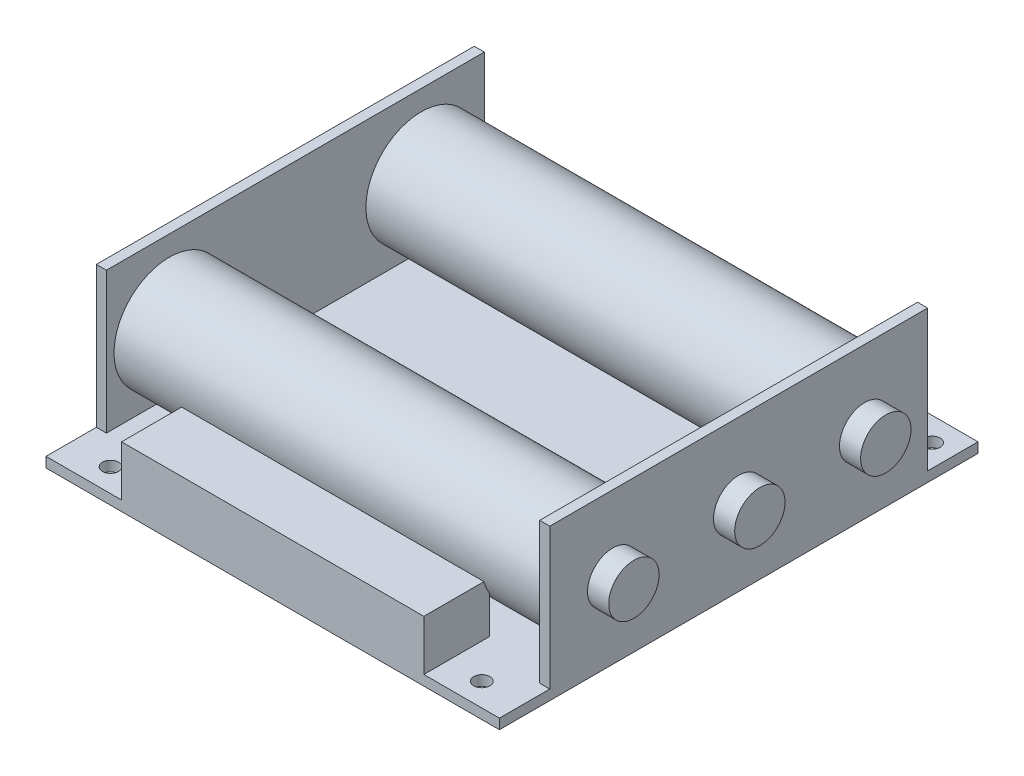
ISO-10303-21;
HEADER;
FILE_DESCRIPTION(('STEP AP214'),'2;1');
FILE_NAME('part.step','',(''),(''),'','','');
FILE_SCHEMA(('AUTOMOTIVE_DESIGN { 1 0 10303 214 1 1 1 1 }'));
ENDSEC;
DATA;
#1=APPLICATION_CONTEXT('core data for automotive mechanical design processes');
#2=APPLICATION_PROTOCOL_DEFINITION('international standard','automotive_design',2000,#1);
#3=PRODUCT_CONTEXT('',#1,'mechanical');
#4=PRODUCT('Part','Part','',(#3));
#5=PRODUCT_RELATED_PRODUCT_CATEGORY('part','',(#4));
#6=PRODUCT_DEFINITION_FORMATION('','',#4);
#7=PRODUCT_DEFINITION_CONTEXT('part definition',#1,'design');
#8=PRODUCT_DEFINITION('design','',#6,#7);
#9=PRODUCT_DEFINITION_SHAPE('','',#8);
#10=(LENGTH_UNIT() NAMED_UNIT(*) SI_UNIT(.MILLI.,.METRE.));
#11=(NAMED_UNIT(*) PLANE_ANGLE_UNIT() SI_UNIT($,.RADIAN.));
#12=(NAMED_UNIT(*) SI_UNIT($,.STERADIAN.) SOLID_ANGLE_UNIT());
#13=UNCERTAINTY_MEASURE_WITH_UNIT(LENGTH_MEASURE(1.E-05),#10,'distance_accuracy_value','');
#14=(GEOMETRIC_REPRESENTATION_CONTEXT(3) GLOBAL_UNCERTAINTY_ASSIGNED_CONTEXT((#13)) GLOBAL_UNIT_ASSIGNED_CONTEXT((#10,
#11,#12)) REPRESENTATION_CONTEXT('',''));
#15=CARTESIAN_POINT('',(0.,0.,0.));
#16=DIRECTION('',(0.,0.,1.));
#17=DIRECTION('',(1.,0.,0.));
#18=AXIS2_PLACEMENT_3D('',#15,#16,#17);
#19=CARTESIAN_POINT('',(-49.2,15.,25.));
#20=DIRECTION('',(1.,0.,0.));
#21=DIRECTION('',(0.,0.,-1.));
#22=AXIS2_PLACEMENT_3D('',#19,#20,#21);
#23=CYLINDRICAL_SURFACE('',#22,11.);
#24=CARTESIAN_POINT('',(43.,15.,25.));
#25=DIRECTION('',(1.,0.,0.));
#26=DIRECTION('',(0.,0.,-1.));
#27=AXIS2_PLACEMENT_3D('',#24,#25,#26);
#28=CIRCLE('',#27,11.);
#29=CARTESIAN_POINT('',(43.,15.,14.));
#30=VERTEX_POINT('',#29);
#31=EDGE_CURVE('E11',#30,#30,#28,.F.);
#32=ORIENTED_EDGE('',*,*,#31,.T.);
#33=EDGE_LOOP('',(#32));
#34=FACE_BOUND('',#33,.T.);
#35=CARTESIAN_POINT('',(-43.,15.,25.));
#36=DIRECTION('',(1.,0.,0.));
#37=DIRECTION('',(0.,0.,-1.));
#38=AXIS2_PLACEMENT_3D('',#35,#36,#37);
#39=CIRCLE('',#38,11.);
#40=CARTESIAN_POINT('',(-43.,15.,14.));
#41=VERTEX_POINT('',#40);
#42=EDGE_CURVE('E47',#41,#41,#39,.T.);
#43=ORIENTED_EDGE('',*,*,#42,.T.);
#44=EDGE_LOOP('',(#43));
#45=FACE_BOUND('',#44,.T.);
#46=ADVANCED_FACE('F46',(#34,#45),#23,.T.);
#47=OPEN_SHELL('',(#46));
#48=SHELL_BASED_SURFACE_MODEL('B2',(#47));
#49=CARTESIAN_POINT('',(-49.2,15.,-25.));
#50=DIRECTION('',(1.,0.,0.));
#51=DIRECTION('',(0.,0.,-1.));
#52=AXIS2_PLACEMENT_3D('',#49,#50,#51);
#53=CYLINDRICAL_SURFACE('',#52,11.);
#54=CARTESIAN_POINT('',(43.,15.,-25.));
#55=DIRECTION('',(1.,0.,0.));
#56=DIRECTION('',(0.,0.,-1.));
#57=AXIS2_PLACEMENT_3D('',#54,#55,#56);
#58=CIRCLE('',#57,11.);
#59=CARTESIAN_POINT('',(43.,15.,-36.));
#60=VERTEX_POINT('',#59);
#61=EDGE_CURVE('E86',#60,#60,#58,.F.);
#62=ORIENTED_EDGE('',*,*,#61,.T.);
#63=EDGE_LOOP('',(#62));
#64=FACE_BOUND('',#63,.T.);
#65=CARTESIAN_POINT('',(-43.,15.,-25.));
#66=DIRECTION('',(1.,0.,0.));
#67=DIRECTION('',(0.,0.,-1.));
#68=AXIS2_PLACEMENT_3D('',#65,#66,#67);
#69=CIRCLE('',#68,11.);
#70=CARTESIAN_POINT('',(-43.,15.,-36.));
#71=VERTEX_POINT('',#70);
#72=EDGE_CURVE('E45',#71,#71,#69,.T.);
#73=ORIENTED_EDGE('',*,*,#72,.T.);
#74=EDGE_LOOP('',(#73));
#75=FACE_BOUND('',#74,.T.);
#76=ADVANCED_FACE('F82',(#64,#75),#53,.T.);
#77=OPEN_SHELL('',(#76));
#78=SHELL_BASED_SURFACE_MODEL('B6',(#77));
#79=CARTESIAN_POINT('',(-45.,2.,-47.5));
#80=DIRECTION('',(1.,0.,0.));
#81=DIRECTION('',(0.,0.,-1.));
#82=AXIS2_PLACEMENT_3D('',#79,#80,#81);
#83=PLANE('',#82);
#84=DIRECTION('',(0.,0.,1.));
#85=VECTOR('',#84,1.);
#86=CARTESIAN_POINT('',(-45.,0.,-47.5));
#87=LINE('',#86,#85);
#88=CARTESIAN_POINT('',(-45.,0.,-47.5));
#89=VERTEX_POINT('',#88);
#90=CARTESIAN_POINT('',(-45.,0.,47.5));
#91=VERTEX_POINT('',#90);
#92=EDGE_CURVE('E358',#89,#91,#87,.T.);
#93=ORIENTED_EDGE('',*,*,#92,.T.);
#94=DIRECTION('',(0.,-1.,0.));
#95=VECTOR('',#94,1.);
#96=CARTESIAN_POINT('',(-45.,2.,47.5));
#97=LINE('',#96,#95);
#98=CARTESIAN_POINT('',(-45.,2.,47.5));
#99=VERTEX_POINT('',#98);
#100=EDGE_CURVE('E386',#99,#91,#97,.T.);
#101=ORIENTED_EDGE('',*,*,#100,.F.);
#102=DIRECTION('',(0.,0.,1.));
#103=VECTOR('',#102,1.);
#104=CARTESIAN_POINT('',(-45.,2.,-47.5));
#105=LINE('',#104,#103);
#106=CARTESIAN_POINT('',(-45.,2.,37.5));
#107=VERTEX_POINT('',#106);
#108=EDGE_CURVE('E362',#107,#99,#105,.T.);
#109=ORIENTED_EDGE('',*,*,#108,.F.);
#110=DIRECTION('',(0.,-1.,0.));
#111=VECTOR('',#110,1.);
#112=CARTESIAN_POINT('',(-45.,0.,37.5));
#113=LINE('',#112,#111);
#114=CARTESIAN_POINT('',(-45.,30.,37.5));
#115=VERTEX_POINT('',#114);
#116=EDGE_CURVE('E278',#115,#107,#113,.T.);
#117=ORIENTED_EDGE('',*,*,#116,.F.);
#118=DIRECTION('',(0.,0.,1.));
#119=VECTOR('',#118,1.);
#120=CARTESIAN_POINT('',(-45.,30.,37.5));
#121=LINE('',#120,#119);
#122=CARTESIAN_POINT('',(-45.,30.,-37.5));
#123=VERTEX_POINT('',#122);
#124=EDGE_CURVE('E290',#123,#115,#121,.T.);
#125=ORIENTED_EDGE('',*,*,#124,.F.);
#126=DIRECTION('',(0.,1.,0.));
#127=VECTOR('',#126,1.);
#128=CARTESIAN_POINT('',(-45.,0.,-37.5));
#129=LINE('',#128,#127);
#130=CARTESIAN_POINT('',(-45.,2.,-37.5));
#131=VERTEX_POINT('',#130);
#132=EDGE_CURVE('E283',#131,#123,#129,.T.);
#133=ORIENTED_EDGE('',*,*,#132,.F.);
#134=CARTESIAN_POINT('',(-45.,2.,-47.5));
#135=VERTEX_POINT('',#134);
#136=EDGE_CURVE('E359',#135,#131,#105,.T.);
#137=ORIENTED_EDGE('',*,*,#136,.F.);
#138=DIRECTION('',(0.,-1.,0.));
#139=VECTOR('',#138,1.);
#140=CARTESIAN_POINT('',(-45.,2.,-47.5));
#141=LINE('',#140,#139);
#142=EDGE_CURVE('E370',#135,#89,#141,.T.);
#143=ORIENTED_EDGE('',*,*,#142,.T.);
#144=EDGE_LOOP('',(#93,#101,#109,#117,#125,#133,#137,#143));
#145=FACE_BOUND('',#144,.T.);
#146=CARTESIAN_POINT('',(-45.,15.,25.));
#147=DIRECTION('',(1.,0.,0.));
#148=DIRECTION('',(0.,0.,-1.));
#149=AXIS2_PLACEMENT_3D('',#146,#147,#148);
#150=CIRCLE('',#149,5.);
#151=CARTESIAN_POINT('',(-45.,15.,20.));
#152=VERTEX_POINT('',#151);
#153=EDGE_CURVE('E275',#152,#152,#150,.T.);
#154=ORIENTED_EDGE('',*,*,#153,.T.);
#155=EDGE_LOOP('',(#154));
#156=FACE_BOUND('',#155,.T.);
#157=CARTESIAN_POINT('',(-45.,15.,-25.));
#158=DIRECTION('',(1.,0.,0.));
#159=DIRECTION('',(0.,0.,-1.));
#160=AXIS2_PLACEMENT_3D('',#157,#158,#159);
#161=CIRCLE('',#160,5.);
#162=CARTESIAN_POINT('',(-45.,15.,-30.));
#163=VERTEX_POINT('',#162);
#164=EDGE_CURVE('E259',#163,#163,#161,.T.);
#165=ORIENTED_EDGE('',*,*,#164,.T.);
#166=EDGE_LOOP('',(#165));
#167=FACE_BOUND('',#166,.T.);
#168=CARTESIAN_POINT('',(-45.,15.,0.));
#169=DIRECTION('',(1.,0.,0.));
#170=DIRECTION('',(0.,0.,-1.));
#171=AXIS2_PLACEMENT_3D('',#168,#169,#170);
#172=CIRCLE('',#171,5.);
#173=CARTESIAN_POINT('',(-45.,15.,-4.99999999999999));
#174=VERTEX_POINT('',#173);
#175=EDGE_CURVE('E80',#174,#174,#172,.F.);
#176=ORIENTED_EDGE('',*,*,#175,.F.);
#177=EDGE_LOOP('',(#176));
#178=FACE_BOUND('',#177,.T.);
#179=ADVANCED_FACE('F109',(#145,#156,#167,#178),#83,.F.);
#180=CARTESIAN_POINT('',(0.,2.,0.));
#181=DIRECTION('',(0.,-1.,0.));
#182=DIRECTION('',(0.,0.,-1.));
#183=AXIS2_PLACEMENT_3D('',#180,#181,#182);
#184=PLANE('',#183);
#185=CARTESIAN_POINT('',(-36.8,2.,42.9));
#186=DIRECTION('',(0.,-1.,0.));
#187=DIRECTION('',(0.,0.,-1.));
#188=AXIS2_PLACEMENT_3D('',#185,#186,#187);
#189=CIRCLE('',#188,1.6);
#190=CARTESIAN_POINT('',(-36.8,2.,41.3));
#191=VERTEX_POINT('',#190);
#192=EDGE_CURVE('E337',#191,#191,#189,.T.);
#193=ORIENTED_EDGE('',*,*,#192,.T.);
#194=EDGE_LOOP('',(#193));
#195=FACE_BOUND('',#194,.T.);
#196=CARTESIAN_POINT('',(36.9,2.,42.9));
#197=DIRECTION('',(0.,-1.,0.));
#198=DIRECTION('',(0.,0.,-1.));
#199=AXIS2_PLACEMENT_3D('',#196,#197,#198);
#200=CIRCLE('',#199,1.6);
#201=CARTESIAN_POINT('',(36.9,2.,41.3));
#202=VERTEX_POINT('',#201);
#203=EDGE_CURVE('E343',#202,#202,#200,.T.);
#204=ORIENTED_EDGE('',*,*,#203,.T.);
#205=EDGE_LOOP('',(#204));
#206=FACE_BOUND('',#205,.T.);
#207=CARTESIAN_POINT('',(40.6,2.,-42.8));
#208=DIRECTION('',(0.,-1.,0.));
#209=DIRECTION('',(0.,0.,-1.));
#210=AXIS2_PLACEMENT_3D('',#207,#208,#209);
#211=CIRCLE('',#210,1.6);
#212=CARTESIAN_POINT('',(40.6,2.,-44.4));
#213=VERTEX_POINT('',#212);
#214=EDGE_CURVE('E349',#213,#213,#211,.T.);
#215=ORIENTED_EDGE('',*,*,#214,.T.);
#216=EDGE_LOOP('',(#215));
#217=FACE_BOUND('',#216,.T.);
#218=CARTESIAN_POINT('',(-39.4,2.,-42.8));
#219=DIRECTION('',(0.,-1.,0.));
#220=DIRECTION('',(0.,0.,-1.));
#221=AXIS2_PLACEMENT_3D('',#218,#219,#220);
#222=CIRCLE('',#221,1.6);
#223=CARTESIAN_POINT('',(-39.4,2.,-44.4));
#224=VERTEX_POINT('',#223);
#225=EDGE_CURVE('E355',#224,#224,#222,.T.);
#226=ORIENTED_EDGE('',*,*,#225,.T.);
#227=EDGE_LOOP('',(#226));
#228=FACE_BOUND('',#227,.T.);
#229=DIRECTION('',(0.,0.,1.));
#230=VECTOR('',#229,1.);
#231=CARTESIAN_POINT('',(-30.,2.,34.5));
#232=LINE('',#231,#230);
#233=CARTESIAN_POINT('',(-30.,2.,34.5));
#234=VERTEX_POINT('',#233);
#235=CARTESIAN_POINT('',(-30.,2.,47.5));
#236=VERTEX_POINT('',#235);
#237=EDGE_CURVE('E123',#234,#236,#232,.T.);
#238=ORIENTED_EDGE('',*,*,#237,.F.);
#239=DIRECTION('',(-1.,0.,0.));
#240=VECTOR('',#239,1.);
#241=CARTESIAN_POINT('',(-30.,2.,34.5));
#242=LINE('',#241,#240);
#243=CARTESIAN_POINT('',(30.,2.,34.5));
#244=VERTEX_POINT('',#243);
#245=EDGE_CURVE('E127',#244,#234,#242,.T.);
#246=ORIENTED_EDGE('',*,*,#245,.F.);
#247=DIRECTION('',(0.,0.,-1.));
#248=VECTOR('',#247,1.);
#249=CARTESIAN_POINT('',(30.,2.,34.5));
#250=LINE('',#249,#248);
#251=CARTESIAN_POINT('',(30.,2.,47.5));
#252=VERTEX_POINT('',#251);
#253=EDGE_CURVE('E578',#252,#244,#250,.T.);
#254=ORIENTED_EDGE('',*,*,#253,.F.);
#255=DIRECTION('',(1.,0.,0.));
#256=VECTOR('',#255,1.);
#257=CARTESIAN_POINT('',(45.,2.,47.5));
#258=LINE('',#257,#256);
#259=CARTESIAN_POINT('',(45.,2.,47.5));
#260=VERTEX_POINT('',#259);
#261=EDGE_CURVE('E361',#252,#260,#258,.T.);
#262=ORIENTED_EDGE('',*,*,#261,.T.);
#263=DIRECTION('',(0.,0.,-1.));
#264=VECTOR('',#263,1.);
#265=CARTESIAN_POINT('',(45.,2.,-47.5));
#266=LINE('',#265,#264);
#267=CARTESIAN_POINT('',(45.,2.,37.5));
#268=VERTEX_POINT('',#267);
#269=EDGE_CURVE('E366',#260,#268,#266,.T.);
#270=ORIENTED_EDGE('',*,*,#269,.T.);
#271=DIRECTION('',(-1.,0.,0.));
#272=VECTOR('',#271,1.);
#273=CARTESIAN_POINT('',(0.,2.,37.5));
#274=LINE('',#273,#272);
#275=CARTESIAN_POINT('',(43.,2.,37.5));
#276=VERTEX_POINT('',#275);
#277=EDGE_CURVE('E332',#268,#276,#274,.T.);
#278=ORIENTED_EDGE('',*,*,#277,.T.);
#279=DIRECTION('',(0.,0.,-1.));
#280=VECTOR('',#279,1.);
#281=CARTESIAN_POINT('',(43.,2.,0.));
#282=LINE('',#281,#280);
#283=CARTESIAN_POINT('',(43.,2.,-37.5));
#284=VERTEX_POINT('',#283);
#285=EDGE_CURVE('E325',#276,#284,#282,.T.);
#286=ORIENTED_EDGE('',*,*,#285,.T.);
#287=DIRECTION('',(1.,0.,0.));
#288=VECTOR('',#287,1.);
#289=CARTESIAN_POINT('',(0.,2.,-37.5));
#290=LINE('',#289,#288);
#291=CARTESIAN_POINT('',(45.,2.,-37.5));
#292=VERTEX_POINT('',#291);
#293=EDGE_CURVE('E329',#284,#292,#290,.T.);
#294=ORIENTED_EDGE('',*,*,#293,.T.);
#295=CARTESIAN_POINT('',(45.,2.,-47.5));
#296=VERTEX_POINT('',#295);
#297=EDGE_CURVE('E365',#292,#296,#266,.T.);
#298=ORIENTED_EDGE('',*,*,#297,.T.);
#299=DIRECTION('',(-1.,0.,0.));
#300=VECTOR('',#299,1.);
#301=CARTESIAN_POINT('',(45.,2.,-47.5));
#302=LINE('',#301,#300);
#303=EDGE_CURVE('E368',#296,#135,#302,.T.);
#304=ORIENTED_EDGE('',*,*,#303,.T.);
#305=ORIENTED_EDGE('',*,*,#136,.T.);
#306=DIRECTION('',(-1.,0.,0.));
#307=VECTOR('',#306,1.);
#308=CARTESIAN_POINT('',(0.,2.,-37.5));
#309=LINE('',#308,#307);
#310=CARTESIAN_POINT('',(-43.,2.,-37.5));
#311=VERTEX_POINT('',#310);
#312=EDGE_CURVE('E300',#311,#131,#309,.T.);
#313=ORIENTED_EDGE('',*,*,#312,.F.);
#314=DIRECTION('',(0.,0.,1.));
#315=VECTOR('',#314,1.);
#316=CARTESIAN_POINT('',(-43.,2.,0.));
#317=LINE('',#316,#315);
#318=CARTESIAN_POINT('',(-43.,2.,37.5));
#319=VERTEX_POINT('',#318);
#320=EDGE_CURVE('E296',#311,#319,#317,.T.);
#321=ORIENTED_EDGE('',*,*,#320,.T.);
#322=DIRECTION('',(1.,0.,0.));
#323=VECTOR('',#322,1.);
#324=CARTESIAN_POINT('',(0.,2.,37.5));
#325=LINE('',#324,#323);
#326=EDGE_CURVE('E303',#107,#319,#325,.T.);
#327=ORIENTED_EDGE('',*,*,#326,.F.);
#328=ORIENTED_EDGE('',*,*,#108,.T.);
#329=EDGE_CURVE('E363',#99,#236,#258,.T.);
#330=ORIENTED_EDGE('',*,*,#329,.T.);
#331=EDGE_LOOP('',(#238,#246,#254,#262,#270,#278,#286,#294,#298,#304,#305,#313,#321,#327,#328,#330));
#332=FACE_BOUND('',#331,.T.);
#333=ADVANCED_FACE('F417',(#195,#206,#217,#228,#332),#184,.F.);
#334=CARTESIAN_POINT('',(45.,2.,47.5));
#335=DIRECTION('',(0.,0.,-1.));
#336=DIRECTION('',(-1.,0.,0.));
#337=AXIS2_PLACEMENT_3D('',#334,#335,#336);
#338=PLANE('',#337);
#339=DIRECTION('',(1.,0.,0.));
#340=VECTOR('',#339,1.);
#341=CARTESIAN_POINT('',(45.,0.,47.5));
#342=LINE('',#341,#340);
#343=CARTESIAN_POINT('',(45.,0.,47.5));
#344=VERTEX_POINT('',#343);
#345=EDGE_CURVE('E372',#91,#344,#342,.T.);
#346=ORIENTED_EDGE('',*,*,#345,.T.);
#347=DIRECTION('',(0.,-1.,0.));
#348=VECTOR('',#347,1.);
#349=CARTESIAN_POINT('',(45.,2.,47.5));
#350=LINE('',#349,#348);
#351=EDGE_CURVE('E383',#260,#344,#350,.T.);
#352=ORIENTED_EDGE('',*,*,#351,.F.);
#353=ORIENTED_EDGE('',*,*,#261,.F.);
#354=DIRECTION('',(0.,-1.,0.));
#355=VECTOR('',#354,1.);
#356=CARTESIAN_POINT('',(30.,12.,47.5));
#357=LINE('',#356,#355);
#358=CARTESIAN_POINT('',(30.,12.,47.5));
#359=VERTEX_POINT('',#358);
#360=EDGE_CURVE('E227',#359,#252,#357,.T.);
#361=ORIENTED_EDGE('',*,*,#360,.F.);
#362=DIRECTION('',(1.,0.,0.));
#363=VECTOR('',#362,1.);
#364=CARTESIAN_POINT('',(-30.,12.,47.5));
#365=LINE('',#364,#363);
#366=CARTESIAN_POINT('',(-30.,12.,47.5));
#367=VERTEX_POINT('',#366);
#368=EDGE_CURVE('E220',#367,#359,#365,.T.);
#369=ORIENTED_EDGE('',*,*,#368,.F.);
#370=DIRECTION('',(0.,-1.,0.));
#371=VECTOR('',#370,1.);
#372=CARTESIAN_POINT('',(-30.,12.,47.5));
#373=LINE('',#372,#371);
#374=EDGE_CURVE('E225',#367,#236,#373,.T.);
#375=ORIENTED_EDGE('',*,*,#374,.T.);
#376=ORIENTED_EDGE('',*,*,#329,.F.);
#377=ORIENTED_EDGE('',*,*,#100,.T.);
#378=EDGE_LOOP('',(#346,#352,#353,#361,#369,#375,#376,#377));
#379=FACE_BOUND('',#378,.T.);
#380=ADVANCED_FACE('F222',(#379),#338,.F.);
#381=CARTESIAN_POINT('',(45.,2.,-47.5));
#382=DIRECTION('',(-1.,0.,0.));
#383=DIRECTION('',(0.,0.,1.));
#384=AXIS2_PLACEMENT_3D('',#381,#382,#383);
#385=PLANE('',#384);
#386=CARTESIAN_POINT('',(45.,15.,0.));
#387=DIRECTION('',(-1.,0.,0.));
#388=DIRECTION('',(0.,0.,1.));
#389=AXIS2_PLACEMENT_3D('',#386,#387,#388);
#390=CIRCLE('',#389,5.);
#391=CARTESIAN_POINT('',(45.,15.,5.00000000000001));
#392=VERTEX_POINT('',#391);
#393=EDGE_CURVE('E567',#392,#392,#390,.T.);
#394=ORIENTED_EDGE('',*,*,#393,.T.);
#395=EDGE_LOOP('',(#394));
#396=FACE_BOUND('',#395,.T.);
#397=CARTESIAN_POINT('',(45.,15.,-25.));
#398=DIRECTION('',(-1.,0.,0.));
#399=DIRECTION('',(0.,0.,1.));
#400=AXIS2_PLACEMENT_3D('',#397,#398,#399);
#401=CIRCLE('',#400,5.);
#402=CARTESIAN_POINT('',(45.,15.,-20.));
#403=VERTEX_POINT('',#402);
#404=EDGE_CURVE('E253',#403,#403,#401,.T.);
#405=ORIENTED_EDGE('',*,*,#404,.T.);
#406=EDGE_LOOP('',(#405));
#407=FACE_BOUND('',#406,.T.);
#408=CARTESIAN_POINT('',(45.,15.,25.));
#409=DIRECTION('',(-1.,0.,0.));
#410=DIRECTION('',(0.,0.,1.));
#411=AXIS2_PLACEMENT_3D('',#408,#409,#410);
#412=CIRCLE('',#411,5.);
#413=CARTESIAN_POINT('',(45.,15.,30.));
#414=VERTEX_POINT('',#413);
#415=EDGE_CURVE('E268',#414,#414,#412,.T.);
#416=ORIENTED_EDGE('',*,*,#415,.T.);
#417=EDGE_LOOP('',(#416));
#418=FACE_BOUND('',#417,.T.);
#419=ORIENTED_EDGE('',*,*,#297,.F.);
#420=DIRECTION('',(0.,1.,0.));
#421=VECTOR('',#420,1.);
#422=CARTESIAN_POINT('',(45.,0.,-37.5));
#423=LINE('',#422,#421);
#424=CARTESIAN_POINT('',(45.,30.,-37.5));
#425=VERTEX_POINT('',#424);
#426=EDGE_CURVE('E319',#292,#425,#423,.T.);
#427=ORIENTED_EDGE('',*,*,#426,.T.);
#428=DIRECTION('',(0.,0.,1.));
#429=VECTOR('',#428,1.);
#430=CARTESIAN_POINT('',(45.,30.,37.5));
#431=LINE('',#430,#429);
#432=CARTESIAN_POINT('',(45.,30.,37.5));
#433=VERTEX_POINT('',#432);
#434=EDGE_CURVE('E311',#425,#433,#431,.T.);
#435=ORIENTED_EDGE('',*,*,#434,.T.);
#436=DIRECTION('',(0.,-1.,0.));
#437=VECTOR('',#436,1.);
#438=CARTESIAN_POINT('',(45.,0.,37.5));
#439=LINE('',#438,#437);
#440=EDGE_CURVE('E306',#433,#268,#439,.T.);
#441=ORIENTED_EDGE('',*,*,#440,.T.);
#442=ORIENTED_EDGE('',*,*,#269,.F.);
#443=ORIENTED_EDGE('',*,*,#351,.T.);
#444=DIRECTION('',(0.,0.,-1.));
#445=VECTOR('',#444,1.);
#446=CARTESIAN_POINT('',(45.,0.,-47.5));
#447=LINE('',#446,#445);
#448=CARTESIAN_POINT('',(45.,0.,-47.5));
#449=VERTEX_POINT('',#448);
#450=EDGE_CURVE('E374',#344,#449,#447,.T.);
#451=ORIENTED_EDGE('',*,*,#450,.T.);
#452=DIRECTION('',(0.,-1.,0.));
#453=VECTOR('',#452,1.);
#454=CARTESIAN_POINT('',(45.,2.,-47.5));
#455=LINE('',#454,#453);
#456=EDGE_CURVE('E380',#296,#449,#455,.T.);
#457=ORIENTED_EDGE('',*,*,#456,.F.);
#458=EDGE_LOOP('',(#419,#427,#435,#441,#442,#443,#451,#457));
#459=FACE_BOUND('',#458,.T.);
#460=ADVANCED_FACE('F433',(#396,#407,#418,#459),#385,.F.);
#461=CARTESIAN_POINT('',(45.,2.,-47.5));
#462=DIRECTION('',(0.,0.,1.));
#463=DIRECTION('',(1.,0.,0.));
#464=AXIS2_PLACEMENT_3D('',#461,#462,#463);
#465=PLANE('',#464);
#466=DIRECTION('',(-1.,0.,0.));
#467=VECTOR('',#466,1.);
#468=CARTESIAN_POINT('',(45.,0.,-47.5));
#469=LINE('',#468,#467);
#470=EDGE_CURVE('E376',#449,#89,#469,.T.);
#471=ORIENTED_EDGE('',*,*,#470,.T.);
#472=ORIENTED_EDGE('',*,*,#142,.F.);
#473=ORIENTED_EDGE('',*,*,#303,.F.);
#474=ORIENTED_EDGE('',*,*,#456,.T.);
#475=EDGE_LOOP('',(#471,#472,#473,#474));
#476=FACE_BOUND('',#475,.T.);
#477=ADVANCED_FACE('F455',(#476),#465,.F.);
#478=CARTESIAN_POINT('',(0.,0.,0.));
#479=DIRECTION('',(0.,-1.,0.));
#480=DIRECTION('',(0.,0.,-1.));
#481=AXIS2_PLACEMENT_3D('',#478,#479,#480);
#482=PLANE('',#481);
#483=ORIENTED_EDGE('',*,*,#345,.F.);
#484=ORIENTED_EDGE('',*,*,#92,.F.);
#485=ORIENTED_EDGE('',*,*,#470,.F.);
#486=ORIENTED_EDGE('',*,*,#450,.F.);
#487=EDGE_LOOP('',(#483,#484,#485,#486));
#488=FACE_BOUND('',#487,.T.);
#489=CARTESIAN_POINT('',(-39.4,0.,-42.8));
#490=DIRECTION('',(0.,-1.,0.));
#491=DIRECTION('',(0.,0.,-1.));
#492=AXIS2_PLACEMENT_3D('',#489,#490,#491);
#493=CIRCLE('',#492,1.59999999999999);
#494=CARTESIAN_POINT('',(-39.4,0.,-44.4));
#495=VERTEX_POINT('',#494);
#496=EDGE_CURVE('E352',#495,#495,#493,.T.);
#497=ORIENTED_EDGE('',*,*,#496,.F.);
#498=EDGE_LOOP('',(#497));
#499=FACE_BOUND('',#498,.T.);
#500=CARTESIAN_POINT('',(40.6,0.,-42.8));
#501=DIRECTION('',(0.,-1.,0.));
#502=DIRECTION('',(0.,0.,-1.));
#503=AXIS2_PLACEMENT_3D('',#500,#501,#502);
#504=CIRCLE('',#503,1.59999999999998);
#505=CARTESIAN_POINT('',(40.6,0.,-44.4));
#506=VERTEX_POINT('',#505);
#507=EDGE_CURVE('E346',#506,#506,#504,.T.);
#508=ORIENTED_EDGE('',*,*,#507,.F.);
#509=EDGE_LOOP('',(#508));
#510=FACE_BOUND('',#509,.T.);
#511=CARTESIAN_POINT('',(36.9,0.,42.9));
#512=DIRECTION('',(0.,-1.,0.));
#513=DIRECTION('',(0.,0.,-1.));
#514=AXIS2_PLACEMENT_3D('',#511,#512,#513);
#515=CIRCLE('',#514,1.59999999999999);
#516=CARTESIAN_POINT('',(36.9,0.,41.3));
#517=VERTEX_POINT('',#516);
#518=EDGE_CURVE('E340',#517,#517,#515,.T.);
#519=ORIENTED_EDGE('',*,*,#518,.F.);
#520=EDGE_LOOP('',(#519));
#521=FACE_BOUND('',#520,.T.);
#522=CARTESIAN_POINT('',(-36.8,0.,42.9));
#523=DIRECTION('',(0.,-1.,0.));
#524=DIRECTION('',(0.,0.,-1.));
#525=AXIS2_PLACEMENT_3D('',#522,#523,#524);
#526=CIRCLE('',#525,1.59999999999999);
#527=CARTESIAN_POINT('',(-36.8,0.,41.3));
#528=VERTEX_POINT('',#527);
#529=EDGE_CURVE('E334',#528,#528,#526,.T.);
#530=ORIENTED_EDGE('',*,*,#529,.F.);
#531=EDGE_LOOP('',(#530));
#532=FACE_BOUND('',#531,.T.);
#533=ADVANCED_FACE('F428',(#488,#499,#510,#521,#532),#482,.T.);
#534=CARTESIAN_POINT('',(-39.4,0.,-42.8));
#535=DIRECTION('',(0.,-1.,0.));
#536=DIRECTION('',(0.,0.,-1.));
#537=AXIS2_PLACEMENT_3D('',#534,#535,#536);
#538=CYLINDRICAL_SURFACE('',#537,1.59999999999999);
#539=ORIENTED_EDGE('',*,*,#225,.F.);
#540=EDGE_LOOP('',(#539));
#541=FACE_BOUND('',#540,.T.);
#542=ORIENTED_EDGE('',*,*,#496,.T.);
#543=EDGE_LOOP('',(#542));
#544=FACE_BOUND('',#543,.T.);
#545=ADVANCED_FACE('F462',(#541,#544),#538,.F.);
#546=CARTESIAN_POINT('',(40.6,0.,-42.8));
#547=DIRECTION('',(0.,-1.,0.));
#548=DIRECTION('',(0.,0.,-1.));
#549=AXIS2_PLACEMENT_3D('',#546,#547,#548);
#550=CYLINDRICAL_SURFACE('',#549,1.59999999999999);
#551=ORIENTED_EDGE('',*,*,#214,.F.);
#552=EDGE_LOOP('',(#551));
#553=FACE_BOUND('',#552,.T.);
#554=ORIENTED_EDGE('',*,*,#507,.T.);
#555=EDGE_LOOP('',(#554));
#556=FACE_BOUND('',#555,.T.);
#557=ADVANCED_FACE('F479',(#553,#556),#550,.F.);
#558=CARTESIAN_POINT('',(36.9,0.,42.9));
#559=DIRECTION('',(0.,-1.,0.));
#560=DIRECTION('',(0.,0.,-1.));
#561=AXIS2_PLACEMENT_3D('',#558,#559,#560);
#562=CYLINDRICAL_SURFACE('',#561,1.59999999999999);
#563=ORIENTED_EDGE('',*,*,#203,.F.);
#564=EDGE_LOOP('',(#563));
#565=FACE_BOUND('',#564,.T.);
#566=ORIENTED_EDGE('',*,*,#518,.T.);
#567=EDGE_LOOP('',(#566));
#568=FACE_BOUND('',#567,.T.);
#569=ADVANCED_FACE('F483',(#565,#568),#562,.F.);
#570=CARTESIAN_POINT('',(-36.8,0.,42.9));
#571=DIRECTION('',(0.,-1.,0.));
#572=DIRECTION('',(0.,0.,-1.));
#573=AXIS2_PLACEMENT_3D('',#570,#571,#572);
#574=CYLINDRICAL_SURFACE('',#573,1.59999999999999);
#575=ORIENTED_EDGE('',*,*,#192,.F.);
#576=EDGE_LOOP('',(#575));
#577=FACE_BOUND('',#576,.T.);
#578=ORIENTED_EDGE('',*,*,#529,.T.);
#579=EDGE_LOOP('',(#578));
#580=FACE_BOUND('',#579,.T.);
#581=ADVANCED_FACE('F487',(#577,#580),#574,.F.);
#582=CARTESIAN_POINT('',(43.,0.,37.5));
#583=DIRECTION('',(0.,0.,1.));
#584=DIRECTION('',(1.,0.,0.));
#585=AXIS2_PLACEMENT_3D('',#582,#583,#584);
#586=PLANE('',#585);
#587=ORIENTED_EDGE('',*,*,#277,.F.);
#588=ORIENTED_EDGE('',*,*,#440,.F.);
#589=DIRECTION('',(1.,0.,0.));
#590=VECTOR('',#589,1.);
#591=CARTESIAN_POINT('',(43.,30.,37.5));
#592=LINE('',#591,#590);
#593=CARTESIAN_POINT('',(43.,30.,37.5));
#594=VERTEX_POINT('',#593);
#595=EDGE_CURVE('E323',#594,#433,#592,.T.);
#596=ORIENTED_EDGE('',*,*,#595,.F.);
#597=DIRECTION('',(0.,-1.,0.));
#598=VECTOR('',#597,1.);
#599=CARTESIAN_POINT('',(43.,0.,37.5));
#600=LINE('',#599,#598);
#601=EDGE_CURVE('E307',#594,#276,#600,.T.);
#602=ORIENTED_EDGE('',*,*,#601,.T.);
#603=EDGE_LOOP('',(#587,#588,#596,#602));
#604=FACE_BOUND('',#603,.T.);
#605=ADVANCED_FACE('F439',(#604),#586,.T.);
#606=CARTESIAN_POINT('',(43.,0.,-37.5));
#607=DIRECTION('',(0.,0.,-1.));
#608=DIRECTION('',(-1.,0.,0.));
#609=AXIS2_PLACEMENT_3D('',#606,#607,#608);
#610=PLANE('',#609);
#611=ORIENTED_EDGE('',*,*,#293,.F.);
#612=DIRECTION('',(0.,1.,0.));
#613=VECTOR('',#612,1.);
#614=CARTESIAN_POINT('',(43.,0.,-37.5));
#615=LINE('',#614,#613);
#616=CARTESIAN_POINT('',(43.,30.,-37.5));
#617=VERTEX_POINT('',#616);
#618=EDGE_CURVE('E310',#284,#617,#615,.T.);
#619=ORIENTED_EDGE('',*,*,#618,.T.);
#620=DIRECTION('',(1.,0.,0.));
#621=VECTOR('',#620,1.);
#622=CARTESIAN_POINT('',(43.,30.,-37.5));
#623=LINE('',#622,#621);
#624=EDGE_CURVE('E316',#617,#425,#623,.T.);
#625=ORIENTED_EDGE('',*,*,#624,.T.);
#626=ORIENTED_EDGE('',*,*,#426,.F.);
#627=EDGE_LOOP('',(#611,#619,#625,#626));
#628=FACE_BOUND('',#627,.T.);
#629=ADVANCED_FACE('F452',(#628),#610,.T.);
#630=CARTESIAN_POINT('',(43.,0.,0.));
#631=DIRECTION('',(-1.,0.,0.));
#632=DIRECTION('',(0.,0.,1.));
#633=AXIS2_PLACEMENT_3D('',#630,#631,#632);
#634=PLANE('',#633);
#635=CARTESIAN_POINT('',(43.,15.,-25.));
#636=DIRECTION('',(-1.,0.,0.));
#637=DIRECTION('',(0.,0.,1.));
#638=AXIS2_PLACEMENT_3D('',#635,#636,#637);
#639=CIRCLE('',#638,5.);
#640=CARTESIAN_POINT('',(43.,15.,-20.));
#641=VERTEX_POINT('',#640);
#642=EDGE_CURVE('E116',#641,#641,#639,.T.);
#643=ORIENTED_EDGE('',*,*,#642,.F.);
#644=EDGE_LOOP('',(#643));
#645=FACE_BOUND('',#644,.T.);
#646=CARTESIAN_POINT('',(43.,15.,25.));
#647=DIRECTION('',(-1.,0.,0.));
#648=DIRECTION('',(0.,0.,1.));
#649=AXIS2_PLACEMENT_3D('',#646,#647,#648);
#650=CIRCLE('',#649,5.);
#651=CARTESIAN_POINT('',(43.,15.,30.));
#652=VERTEX_POINT('',#651);
#653=EDGE_CURVE('E269',#652,#652,#650,.T.);
#654=ORIENTED_EDGE('',*,*,#653,.F.);
#655=EDGE_LOOP('',(#654));
#656=FACE_BOUND('',#655,.T.);
#657=ORIENTED_EDGE('',*,*,#285,.F.);
#658=ORIENTED_EDGE('',*,*,#601,.F.);
#659=DIRECTION('',(0.,0.,1.));
#660=VECTOR('',#659,1.);
#661=CARTESIAN_POINT('',(43.,30.,37.5));
#662=LINE('',#661,#660);
#663=EDGE_CURVE('E313',#617,#594,#662,.T.);
#664=ORIENTED_EDGE('',*,*,#663,.F.);
#665=ORIENTED_EDGE('',*,*,#618,.F.);
#666=EDGE_LOOP('',(#657,#658,#664,#665));
#667=FACE_BOUND('',#666,.T.);
#668=ADVANCED_FACE('F443',(#645,#656,#667),#634,.T.);
#669=CARTESIAN_POINT('',(43.,30.,37.5));
#670=DIRECTION('',(0.,1.,0.));
#671=DIRECTION('',(0.,0.,1.));
#672=AXIS2_PLACEMENT_3D('',#669,#670,#671);
#673=PLANE('',#672);
#674=ORIENTED_EDGE('',*,*,#434,.F.);
#675=ORIENTED_EDGE('',*,*,#624,.F.);
#676=ORIENTED_EDGE('',*,*,#663,.T.);
#677=ORIENTED_EDGE('',*,*,#595,.T.);
#678=EDGE_LOOP('',(#674,#675,#676,#677));
#679=FACE_BOUND('',#678,.T.);
#680=ADVANCED_FACE('F448',(#679),#673,.T.);
#681=CARTESIAN_POINT('',(-43.,0.,37.5));
#682=DIRECTION('',(0.,0.,-1.));
#683=DIRECTION('',(-1.,0.,0.));
#684=AXIS2_PLACEMENT_3D('',#681,#682,#683);
#685=PLANE('',#684);
#686=ORIENTED_EDGE('',*,*,#116,.T.);
#687=ORIENTED_EDGE('',*,*,#326,.T.);
#688=DIRECTION('',(0.,-1.,0.));
#689=VECTOR('',#688,1.);
#690=CARTESIAN_POINT('',(-43.,0.,37.5));
#691=LINE('',#690,#689);
#692=CARTESIAN_POINT('',(-43.,30.,37.5));
#693=VERTEX_POINT('',#692);
#694=EDGE_CURVE('E279',#693,#319,#691,.T.);
#695=ORIENTED_EDGE('',*,*,#694,.F.);
#696=DIRECTION('',(-1.,0.,0.));
#697=VECTOR('',#696,1.);
#698=CARTESIAN_POINT('',(-43.,30.,37.5));
#699=LINE('',#698,#697);
#700=EDGE_CURVE('E287',#693,#115,#699,.T.);
#701=ORIENTED_EDGE('',*,*,#700,.T.);
#702=EDGE_LOOP('',(#686,#687,#695,#701));
#703=FACE_BOUND('',#702,.T.);
#704=ADVANCED_FACE('F416',(#703),#685,.F.);
#705=CARTESIAN_POINT('',(-43.,0.,-37.5));
#706=DIRECTION('',(0.,0.,1.));
#707=DIRECTION('',(1.,0.,0.));
#708=AXIS2_PLACEMENT_3D('',#705,#706,#707);
#709=PLANE('',#708);
#710=DIRECTION('',(0.,1.,0.));
#711=VECTOR('',#710,1.);
#712=CARTESIAN_POINT('',(-43.,0.,-37.5));
#713=LINE('',#712,#711);
#714=CARTESIAN_POINT('',(-43.,30.,-37.5));
#715=VERTEX_POINT('',#714);
#716=EDGE_CURVE('E285',#311,#715,#713,.T.);
#717=ORIENTED_EDGE('',*,*,#716,.F.);
#718=ORIENTED_EDGE('',*,*,#312,.T.);
#719=ORIENTED_EDGE('',*,*,#132,.T.);
#720=DIRECTION('',(-1.,0.,0.));
#721=VECTOR('',#720,1.);
#722=CARTESIAN_POINT('',(-43.,30.,-37.5));
#723=LINE('',#722,#721);
#724=EDGE_CURVE('E293',#715,#123,#723,.T.);
#725=ORIENTED_EDGE('',*,*,#724,.F.);
#726=EDGE_LOOP('',(#717,#718,#719,#725));
#727=FACE_BOUND('',#726,.T.);
#728=ADVANCED_FACE('F399',(#727),#709,.F.);
#729=CARTESIAN_POINT('',(-43.,0.,0.));
#730=DIRECTION('',(1.,0.,0.));
#731=DIRECTION('',(0.,0.,1.));
#732=AXIS2_PLACEMENT_3D('',#729,#730,#731);
#733=PLANE('',#732);
#734=CARTESIAN_POINT('',(-43.,15.,-25.));
#735=DIRECTION('',(1.,0.,0.));
#736=DIRECTION('',(0.,0.,-1.));
#737=AXIS2_PLACEMENT_3D('',#734,#735,#736);
#738=CIRCLE('',#737,5.);
#739=CARTESIAN_POINT('',(-43.,15.,-30.));
#740=VERTEX_POINT('',#739);
#741=EDGE_CURVE('E256',#740,#740,#738,.T.);
#742=ORIENTED_EDGE('',*,*,#741,.F.);
#743=EDGE_LOOP('',(#742));
#744=FACE_BOUND('',#743,.T.);
#745=CARTESIAN_POINT('',(-43.,15.,25.));
#746=DIRECTION('',(1.,0.,0.));
#747=DIRECTION('',(0.,0.,-1.));
#748=AXIS2_PLACEMENT_3D('',#745,#746,#747);
#749=CIRCLE('',#748,5.);
#750=CARTESIAN_POINT('',(-43.,15.,20.));
#751=VERTEX_POINT('',#750);
#752=EDGE_CURVE('E272',#751,#751,#749,.T.);
#753=ORIENTED_EDGE('',*,*,#752,.F.);
#754=EDGE_LOOP('',(#753));
#755=FACE_BOUND('',#754,.T.);
#756=ORIENTED_EDGE('',*,*,#320,.F.);
#757=ORIENTED_EDGE('',*,*,#716,.T.);
#758=DIRECTION('',(0.,0.,1.));
#759=VECTOR('',#758,1.);
#760=CARTESIAN_POINT('',(-43.,30.,37.5));
#761=LINE('',#760,#759);
#762=EDGE_CURVE('E282',#715,#693,#761,.T.);
#763=ORIENTED_EDGE('',*,*,#762,.T.);
#764=ORIENTED_EDGE('',*,*,#694,.T.);
#765=EDGE_LOOP('',(#756,#757,#763,#764));
#766=FACE_BOUND('',#765,.T.);
#767=ADVANCED_FACE('F395',(#744,#755,#766),#733,.T.);
#768=CARTESIAN_POINT('',(-43.,30.,37.5));
#769=DIRECTION('',(0.,-1.,0.));
#770=DIRECTION('',(0.,0.,-1.));
#771=AXIS2_PLACEMENT_3D('',#768,#769,#770);
#772=PLANE('',#771);
#773=ORIENTED_EDGE('',*,*,#124,.T.);
#774=ORIENTED_EDGE('',*,*,#700,.F.);
#775=ORIENTED_EDGE('',*,*,#762,.F.);
#776=ORIENTED_EDGE('',*,*,#724,.T.);
#777=EDGE_LOOP('',(#773,#774,#775,#776));
#778=FACE_BOUND('',#777,.T.);
#779=ADVANCED_FACE('F398',(#778),#772,.F.);
#780=CARTESIAN_POINT('',(-49.2,15.,25.));
#781=DIRECTION('',(1.,0.,0.));
#782=DIRECTION('',(0.,0.,-1.));
#783=AXIS2_PLACEMENT_3D('',#780,#781,#782);
#784=CYLINDRICAL_SURFACE('',#783,5.);
#785=ORIENTED_EDGE('',*,*,#653,.T.);
#786=EDGE_LOOP('',(#785));
#787=FACE_BOUND('',#786,.T.);
#788=ORIENTED_EDGE('',*,*,#752,.T.);
#789=EDGE_LOOP('',(#788));
#790=FACE_BOUND('',#789,.T.);
#791=ADVANCED_FACE('F505',(#787,#790),#784,.T.);
#792=CARTESIAN_POINT('',(49.2,15.,25.));
#793=DIRECTION('',(1.,0.,0.));
#794=DIRECTION('',(0.,0.,-1.));
#795=AXIS2_PLACEMENT_3D('',#792,#793,#794);
#796=PLANE('',#795);
#797=CARTESIAN_POINT('',(49.2,15.,25.));
#798=DIRECTION('',(1.,0.,0.));
#799=DIRECTION('',(0.,0.,-1.));
#800=AXIS2_PLACEMENT_3D('',#797,#798,#799);
#801=CIRCLE('',#800,5.);
#802=CARTESIAN_POINT('',(49.2,15.,20.));
#803=VERTEX_POINT('',#802);
#804=EDGE_CURVE('E262',#803,#803,#801,.T.);
#805=ORIENTED_EDGE('',*,*,#804,.T.);
#806=EDGE_LOOP('',(#805));
#807=FACE_BOUND('',#806,.T.);
#808=ADVANCED_FACE('F510',(#807),#796,.T.);
#809=ORIENTED_EDGE('',*,*,#804,.F.);
#810=EDGE_LOOP('',(#809));
#811=FACE_BOUND('',#810,.T.);
#812=ORIENTED_EDGE('',*,*,#415,.F.);
#813=EDGE_LOOP('',(#812));
#814=FACE_BOUND('',#813,.T.);
#815=ADVANCED_FACE('F513',(#811,#814),#784,.T.);
#816=CARTESIAN_POINT('',(-49.2,15.,25.));
#817=DIRECTION('',(1.,0.,0.));
#818=DIRECTION('',(0.,0.,-1.));
#819=AXIS2_PLACEMENT_3D('',#816,#817,#818);
#820=CIRCLE('',#819,5.);
#821=CARTESIAN_POINT('',(-49.2,15.,20.));
#822=VERTEX_POINT('',#821);
#823=EDGE_CURVE('E265',#822,#822,#820,.T.);
#824=ORIENTED_EDGE('',*,*,#823,.T.);
#825=EDGE_LOOP('',(#824));
#826=FACE_BOUND('',#825,.T.);
#827=ORIENTED_EDGE('',*,*,#153,.F.);
#828=EDGE_LOOP('',(#827));
#829=FACE_BOUND('',#828,.T.);
#830=ADVANCED_FACE('F512',(#826,#829),#784,.T.);
#831=CARTESIAN_POINT('',(-49.2,15.,25.));
#832=DIRECTION('',(1.,0.,0.));
#833=DIRECTION('',(0.,0.,-1.));
#834=AXIS2_PLACEMENT_3D('',#831,#832,#833);
#835=PLANE('',#834);
#836=ORIENTED_EDGE('',*,*,#823,.F.);
#837=EDGE_LOOP('',(#836));
#838=FACE_BOUND('',#837,.T.);
#839=ADVANCED_FACE('F514',(#838),#835,.F.);
#840=CARTESIAN_POINT('',(-49.2,15.,-25.));
#841=DIRECTION('',(1.,0.,0.));
#842=DIRECTION('',(0.,0.,-1.));
#843=AXIS2_PLACEMENT_3D('',#840,#841,#842);
#844=CYLINDRICAL_SURFACE('',#843,5.);
#845=ORIENTED_EDGE('',*,*,#642,.T.);
#846=EDGE_LOOP('',(#845));
#847=FACE_BOUND('',#846,.T.);
#848=ORIENTED_EDGE('',*,*,#741,.T.);
#849=EDGE_LOOP('',(#848));
#850=FACE_BOUND('',#849,.T.);
#851=ADVANCED_FACE('F393',(#847,#850),#844,.T.);
#852=CARTESIAN_POINT('',(49.2,15.,-25.));
#853=DIRECTION('',(1.,0.,0.));
#854=DIRECTION('',(0.,0.,-1.));
#855=AXIS2_PLACEMENT_3D('',#852,#853,#854);
#856=PLANE('',#855);
#857=CARTESIAN_POINT('',(49.2,15.,-25.));
#858=DIRECTION('',(1.,0.,0.));
#859=DIRECTION('',(0.,0.,-1.));
#860=AXIS2_PLACEMENT_3D('',#857,#858,#859);
#861=CIRCLE('',#860,5.);
#862=CARTESIAN_POINT('',(49.2,15.,-30.));
#863=VERTEX_POINT('',#862);
#864=EDGE_CURVE('E242',#863,#863,#861,.T.);
#865=ORIENTED_EDGE('',*,*,#864,.T.);
#866=EDGE_LOOP('',(#865));
#867=FACE_BOUND('',#866,.T.);
#868=ADVANCED_FACE('F523',(#867),#856,.T.);
#869=ORIENTED_EDGE('',*,*,#864,.F.);
#870=EDGE_LOOP('',(#869));
#871=FACE_BOUND('',#870,.T.);
#872=ORIENTED_EDGE('',*,*,#404,.F.);
#873=EDGE_LOOP('',(#872));
#874=FACE_BOUND('',#873,.T.);
#875=ADVANCED_FACE('F526',(#871,#874),#844,.T.);
#876=CARTESIAN_POINT('',(-49.2,15.,-25.));
#877=DIRECTION('',(1.,0.,0.));
#878=DIRECTION('',(0.,0.,-1.));
#879=AXIS2_PLACEMENT_3D('',#876,#877,#878);
#880=CIRCLE('',#879,5.);
#881=CARTESIAN_POINT('',(-49.2,15.,-30.));
#882=VERTEX_POINT('',#881);
#883=EDGE_CURVE('E245',#882,#882,#880,.T.);
#884=ORIENTED_EDGE('',*,*,#883,.T.);
#885=EDGE_LOOP('',(#884));
#886=FACE_BOUND('',#885,.T.);
#887=ORIENTED_EDGE('',*,*,#164,.F.);
#888=EDGE_LOOP('',(#887));
#889=FACE_BOUND('',#888,.T.);
#890=ADVANCED_FACE('F525',(#886,#889),#844,.T.);
#891=CARTESIAN_POINT('',(-49.2,15.,-25.));
#892=DIRECTION('',(1.,0.,0.));
#893=DIRECTION('',(0.,0.,-1.));
#894=AXIS2_PLACEMENT_3D('',#891,#892,#893);
#895=PLANE('',#894);
#896=ORIENTED_EDGE('',*,*,#883,.F.);
#897=EDGE_LOOP('',(#896));
#898=FACE_BOUND('',#897,.T.);
#899=ADVANCED_FACE('F527',(#898),#895,.F.);
#900=CARTESIAN_POINT('',(-30.,12.,34.5));
#901=DIRECTION('',(1.,0.,0.));
#902=DIRECTION('',(0.,0.,-1.));
#903=AXIS2_PLACEMENT_3D('',#900,#901,#902);
#904=PLANE('',#903);
#905=ORIENTED_EDGE('',*,*,#237,.T.);
#906=ORIENTED_EDGE('',*,*,#374,.F.);
#907=DIRECTION('',(0.,0.,1.));
#908=VECTOR('',#907,1.);
#909=CARTESIAN_POINT('',(-30.,12.,34.5));
#910=LINE('',#909,#908);
#911=CARTESIAN_POINT('',(-30.,12.,34.5));
#912=VERTEX_POINT('',#911);
#913=EDGE_CURVE('E231',#912,#367,#910,.T.);
#914=ORIENTED_EDGE('',*,*,#913,.F.);
#915=DIRECTION('',(0.,-1.,0.));
#916=VECTOR('',#915,1.);
#917=CARTESIAN_POINT('',(-30.,12.,34.5));
#918=LINE('',#917,#916);
#919=EDGE_CURVE('E576',#912,#234,#918,.T.);
#920=ORIENTED_EDGE('',*,*,#919,.T.);
#921=EDGE_LOOP('',(#905,#906,#914,#920));
#922=FACE_BOUND('',#921,.T.);
#923=ADVANCED_FACE('F241',(#922),#904,.F.);
#924=CARTESIAN_POINT('',(30.,12.,34.5));
#925=DIRECTION('',(-1.,0.,0.));
#926=DIRECTION('',(0.,0.,1.));
#927=AXIS2_PLACEMENT_3D('',#924,#925,#926);
#928=PLANE('',#927);
#929=ORIENTED_EDGE('',*,*,#253,.T.);
#930=DIRECTION('',(0.,-1.,0.));
#931=VECTOR('',#930,1.);
#932=CARTESIAN_POINT('',(30.,12.,34.5));
#933=LINE('',#932,#931);
#934=CARTESIAN_POINT('',(30.,12.,34.5));
#935=VERTEX_POINT('',#934);
#936=EDGE_CURVE('E247',#935,#244,#933,.T.);
#937=ORIENTED_EDGE('',*,*,#936,.F.);
#938=DIRECTION('',(0.,0.,-1.));
#939=VECTOR('',#938,1.);
#940=CARTESIAN_POINT('',(30.,12.,34.5));
#941=LINE('',#940,#939);
#942=EDGE_CURVE('E230',#359,#935,#941,.T.);
#943=ORIENTED_EDGE('',*,*,#942,.F.);
#944=ORIENTED_EDGE('',*,*,#360,.T.);
#945=EDGE_LOOP('',(#929,#937,#943,#944));
#946=FACE_BOUND('',#945,.T.);
#947=ADVANCED_FACE('F536',(#946),#928,.F.);
#948=CARTESIAN_POINT('',(-30.,12.,34.5));
#949=DIRECTION('',(0.,0.,1.));
#950=DIRECTION('',(1.,0.,0.));
#951=AXIS2_PLACEMENT_3D('',#948,#949,#950);
#952=PLANE('',#951);
#953=ORIENTED_EDGE('',*,*,#245,.T.);
#954=ORIENTED_EDGE('',*,*,#919,.F.);
#955=DIRECTION('',(-1.,0.,0.));
#956=VECTOR('',#955,1.);
#957=CARTESIAN_POINT('',(-30.,12.,34.5));
#958=LINE('',#957,#956);
#959=EDGE_CURVE('E236',#935,#912,#958,.T.);
#960=ORIENTED_EDGE('',*,*,#959,.F.);
#961=ORIENTED_EDGE('',*,*,#936,.T.);
#962=EDGE_LOOP('',(#953,#954,#960,#961));
#963=FACE_BOUND('',#962,.T.);
#964=ADVANCED_FACE('F539',(#963),#952,.F.);
#965=CARTESIAN_POINT('',(0.,12.,0.));
#966=DIRECTION('',(0.,1.,0.));
#967=DIRECTION('',(0.,0.,1.));
#968=AXIS2_PLACEMENT_3D('',#965,#966,#967);
#969=PLANE('',#968);
#970=ORIENTED_EDGE('',*,*,#913,.T.);
#971=ORIENTED_EDGE('',*,*,#368,.T.);
#972=ORIENTED_EDGE('',*,*,#942,.T.);
#973=ORIENTED_EDGE('',*,*,#959,.T.);
#974=EDGE_LOOP('',(#970,#971,#972,#973));
#975=FACE_BOUND('',#974,.T.);
#976=ADVANCED_FACE('F234',(#975),#969,.T.);
#977=CARTESIAN_POINT('',(-49.2,15.,0.));
#978=DIRECTION('',(1.,0.,0.));
#979=DIRECTION('',(0.,0.,-1.));
#980=AXIS2_PLACEMENT_3D('',#977,#978,#979);
#981=CYLINDRICAL_SURFACE('',#980,5.);
#982=CARTESIAN_POINT('',(-49.2,15.,0.));
#983=DIRECTION('',(-1.,0.,0.));
#984=DIRECTION('',(0.,0.,1.));
#985=AXIS2_PLACEMENT_3D('',#982,#983,#984);
#986=CIRCLE('',#985,5.);
#987=CARTESIAN_POINT('',(-49.2,15.,5.00000000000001));
#988=VERTEX_POINT('',#987);
#989=EDGE_CURVE('E566',#988,#988,#986,.T.);
#990=ORIENTED_EDGE('',*,*,#989,.F.);
#991=EDGE_LOOP('',(#990));
#992=FACE_BOUND('',#991,.T.);
#993=ORIENTED_EDGE('',*,*,#175,.T.);
#994=EDGE_LOOP('',(#993));
#995=FACE_BOUND('',#994,.T.);
#996=ADVANCED_FACE('F546',(#992,#995),#981,.T.);
#997=CARTESIAN_POINT('',(-49.2,15.,0.));
#998=DIRECTION('',(-1.,0.,0.));
#999=DIRECTION('',(0.,0.,1.));
#1000=AXIS2_PLACEMENT_3D('',#997,#998,#999);
#1001=PLANE('',#1000);
#1002=ORIENTED_EDGE('',*,*,#989,.T.);
#1003=EDGE_LOOP('',(#1002));
#1004=FACE_BOUND('',#1003,.T.);
#1005=ADVANCED_FACE('F549',(#1004),#1001,.T.);
#1006=CARTESIAN_POINT('',(49.2,15.,0.));
#1007=DIRECTION('',(-1.,0.,0.));
#1008=DIRECTION('',(0.,0.,1.));
#1009=AXIS2_PLACEMENT_3D('',#1006,#1007,#1008);
#1010=CYLINDRICAL_SURFACE('',#1009,5.);
#1011=CARTESIAN_POINT('',(49.2,15.,0.));
#1012=DIRECTION('',(-1.,0.,0.));
#1013=DIRECTION('',(0.,0.,1.));
#1014=AXIS2_PLACEMENT_3D('',#1011,#1012,#1013);
#1015=CIRCLE('',#1014,5.);
#1016=CARTESIAN_POINT('',(49.2,15.,5.00000000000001));
#1017=VERTEX_POINT('',#1016);
#1018=EDGE_CURVE('E565',#1017,#1017,#1015,.T.);
#1019=ORIENTED_EDGE('',*,*,#1018,.T.);
#1020=EDGE_LOOP('',(#1019));
#1021=FACE_BOUND('',#1020,.T.);
#1022=ORIENTED_EDGE('',*,*,#393,.F.);
#1023=EDGE_LOOP('',(#1022));
#1024=FACE_BOUND('',#1023,.T.);
#1025=ADVANCED_FACE('F553',(#1021,#1024),#1010,.T.);
#1026=CARTESIAN_POINT('',(49.2,15.,0.));
#1027=DIRECTION('',(1.,0.,0.));
#1028=DIRECTION('',(0.,0.,1.));
#1029=AXIS2_PLACEMENT_3D('',#1026,#1027,#1028);
#1030=PLANE('',#1029);
#1031=ORIENTED_EDGE('',*,*,#1018,.F.);
#1032=EDGE_LOOP('',(#1031));
#1033=FACE_BOUND('',#1032,.T.);
#1034=ADVANCED_FACE('F557',(#1033),#1030,.T.);
#1035=CLOSED_SHELL('',(#179,#333,#380,#460,#477,#533,#545,#557,#569,#581,#605,#629,#668,#680,
#704,#728,#767,#779,#791,#808,#815,#830,#839,#851,#868,#875,#890,#899,#923,#947,#964,#976,#996,
#1005,#1025,#1034));
#1036=MANIFOLD_SOLID_BREP('B40',#1035);
#1037=ADVANCED_BREP_SHAPE_REPRESENTATION('',(#18,#1036),#14);
#1038=MANIFOLD_SURFACE_SHAPE_REPRESENTATION('',(#18,#48,#78),#14);
#1039=SHAPE_REPRESENTATION('',(#18),#14);
#1040=SHAPE_DEFINITION_REPRESENTATION(#9,#1039);
#1041=SHAPE_REPRESENTATION_RELATIONSHIP('','',#1039,#1037);
#1042=SHAPE_REPRESENTATION_RELATIONSHIP('','',#1039,#1038);
ENDSEC;
END-ISO-10303-21;
